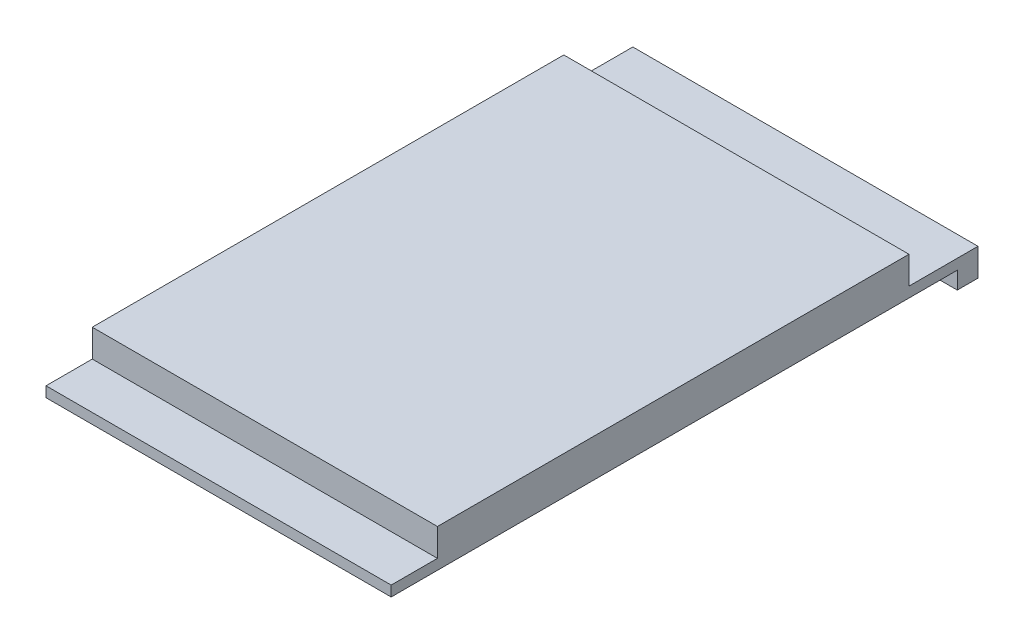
from build123d import *

# Parameters (mm, degrees)
SKETCH1_W           = 50
SKETCH1_H           = 85
BOSS_EXTRUDE1_DEPTH = 8
SKETCH2_W           = 50
SKETCH2_H           = 10
CUT_EXTRUDE1_DEPTH  = 4
SKETCH3_W           = 50
SKETCH3_H           = 6.7
CUT_EXTRUDE2_DEPTH  = 4
SKETCH4_W           = 50
SKETCH4_H           = 82
CUT_EXTRUDE3_DEPTH  = 2.5


with BuildPart() as part:
    # Sketch1 → Boss-Extrude1 (new body)
    with BuildSketch(Plane(origin=(0, 0, 0), x_dir=(1, 0, 0), z_dir=(0, 1, 0))):
        Rectangle(SKETCH1_W, SKETCH1_H)
    extrude(amount=BOSS_EXTRUDE1_DEPTH)

    # Sketch2 → Cut-Extrude1 (cut)
    with BuildSketch(Plane(origin=(0, 8, 0), x_dir=(1, 0, 0), z_dir=(0, 1, 0))):
        with Locations((0, 37.5)):
            Rectangle(SKETCH2_W, SKETCH2_H)
    extrude(amount=-CUT_EXTRUDE1_DEPTH, mode=Mode.SUBTRACT)

    # Sketch3 → Cut-Extrude2 (cut)
    with BuildSketch(Plane(origin=(0, 8, 0), x_dir=(1, 0, 0), z_dir=(0, 1, 0))):
        with Locations((0, -39.15)):
            Rectangle(SKETCH3_W, SKETCH3_H)
    extrude(amount=-CUT_EXTRUDE2_DEPTH, mode=Mode.SUBTRACT)

    # Sketch4 → Cut-Extrude3 (cut)
    with BuildSketch(Plane.XZ):
        with Locations((0, 1.5)):
            Rectangle(SKETCH4_W, SKETCH4_H)
    extrude(amount=-CUT_EXTRUDE3_DEPTH, mode=Mode.SUBTRACT)


solid = part.part
